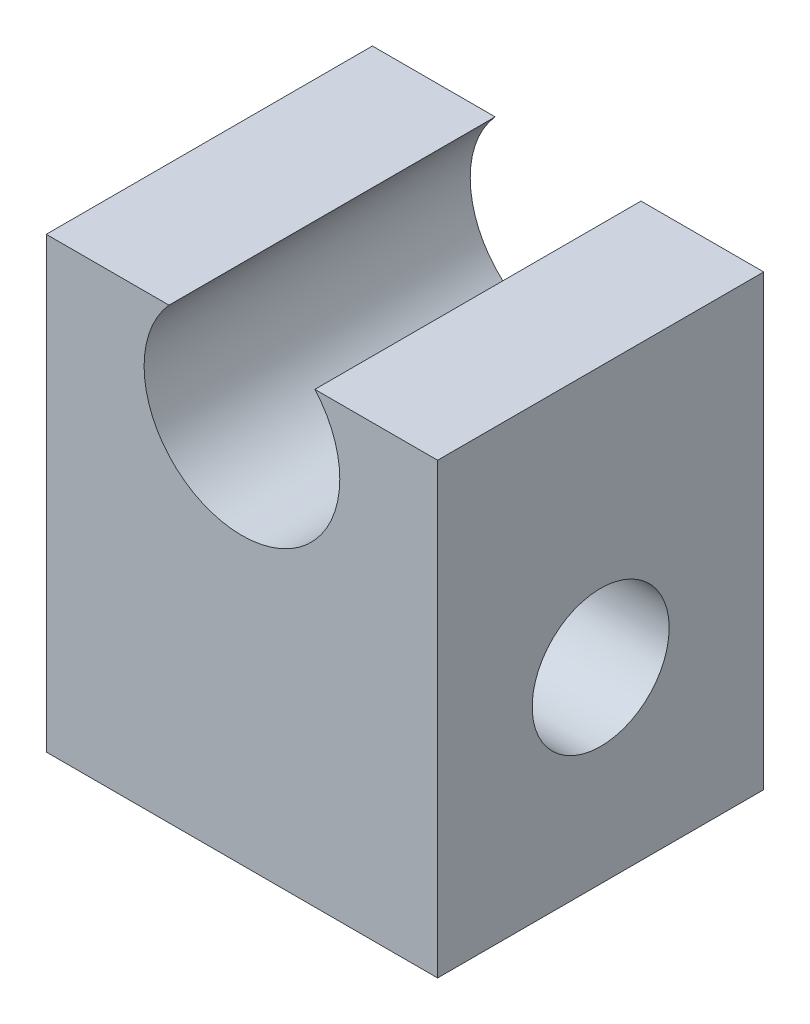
from build123d import *

# Parameters (mm, degrees)
SKETCH_1_W                     = 24
SKETCH_1_H                     = 18
SLIDER_NUT_BLOCK_DEPTH         = 10
SKETCH_2_R                     = 4.2
SCREW_BORE_D8P4_DEPTH          = 25
SKETCH_3_W                     = 24
SKETCH_3_H                     = 19
EXTEND_NUT_BELOW_AXLE_DEPTH    = 10
SKETCH_4_R                     = 4.3
CLOSE_PREVIOUS_BORE_DEPTH      = 12
SKETCH_5_R                     = 4.2
SCREW_BORE_YMINUS12_D8P4_DEPTH = 25
SKETCH_6_R                     = 6
AXLE_SADDLE_D12_DEPTH          = 25


with BuildPart() as part:
    # Sketch 1 → Slider_Nut_Block (new, symmetric)
    with BuildSketch(Plane.XY):
        with Locations((0, -5)):
            Rectangle(SKETCH_1_W, SKETCH_1_H)
    extrude(amount=SLIDER_NUT_BLOCK_DEPTH, both=True)

    # Sketch 2 → Screw_Bore_D8p4 (cut, symmetric)
    with BuildSketch(Plane(origin=(0, 0, 0), x_dir=(0, 0, -1), z_dir=(1, 0, 0))):
        with Locations((0, -5)):
            Circle(SKETCH_2_R)
    extrude(amount=SCREW_BORE_D8P4_DEPTH, both=True, mode=Mode.SUBTRACT)

    # Sketch 3 → Extend_Nut_Below_Axle (add, symmetric)
    with BuildSketch(Plane.XY):
        with Locations((0, -14)):
            Rectangle(SKETCH_3_W, SKETCH_3_H)
    extrude(amount=EXTEND_NUT_BELOW_AXLE_DEPTH, both=True)

    # Sketch 4 → Close_Previous_Bore (add, symmetric)
    with BuildSketch(Plane(origin=(0, 0, 0), x_dir=(0, 0, -1), z_dir=(1, 0, 0))):
        with Locations((0, -5)):
            Circle(SKETCH_4_R)
    extrude(amount=CLOSE_PREVIOUS_BORE_DEPTH, both=True)

    # Sketch 5 → Screw_Bore_Yminus12_D8p4 (cut, symmetric)
    with BuildSketch(Plane(origin=(0, 0, 0), x_dir=(0, 0, -1), z_dir=(1, 0, 0))):
        with Locations((0, -12)):
            Circle(SKETCH_5_R)
    extrude(amount=SCREW_BORE_YMINUS12_D8P4_DEPTH, both=True, mode=Mode.SUBTRACT)

    # Sketch 6 → Axle_Saddle_D12 (cut, symmetric)
    with BuildSketch(Plane.XY):
        Circle(SKETCH_6_R)
    extrude(amount=AXLE_SADDLE_D12_DEPTH, both=True, mode=Mode.SUBTRACT)


solid = part.part
